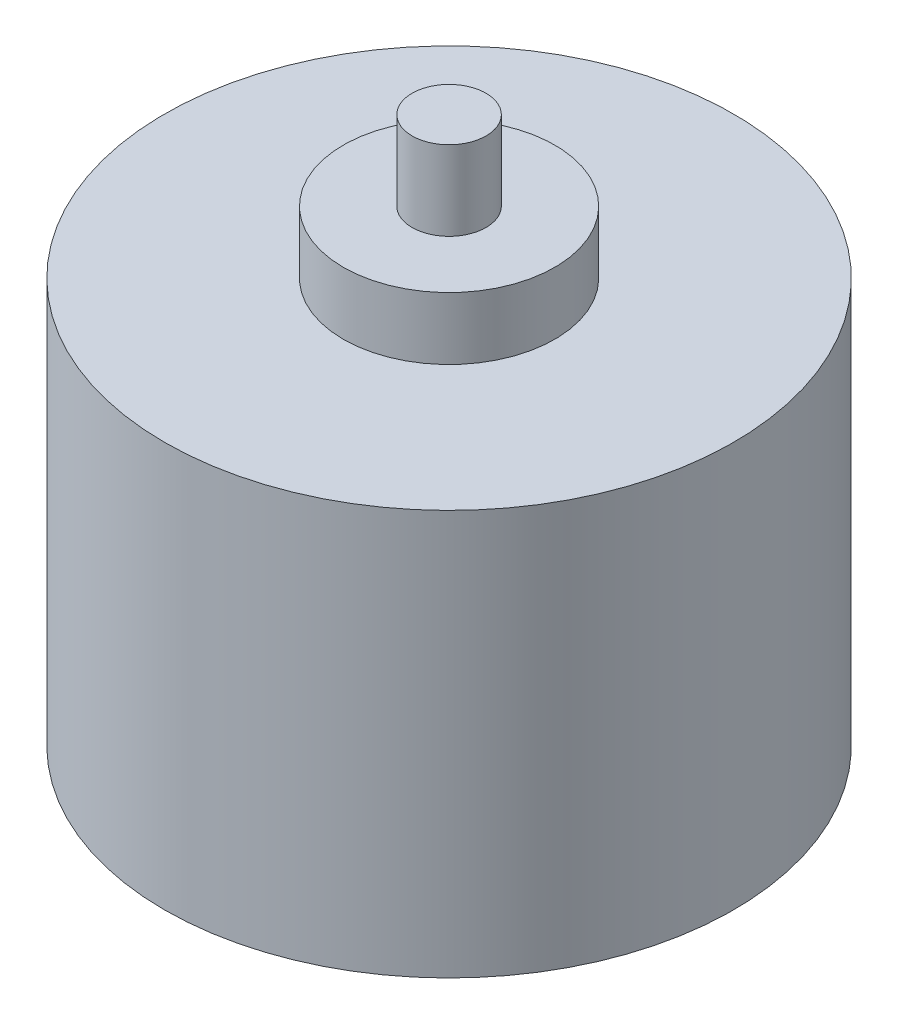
ISO-10303-21;
HEADER;
FILE_DESCRIPTION(('STEP AP214'),'2;1');
FILE_NAME('part.step','',(''),(''),'','','');
FILE_SCHEMA(('AUTOMOTIVE_DESIGN { 1 0 10303 214 1 1 1 1 }'));
ENDSEC;
DATA;
#1=APPLICATION_CONTEXT('core data for automotive mechanical design processes');
#2=APPLICATION_PROTOCOL_DEFINITION('international standard','automotive_design',2000,#1);
#3=PRODUCT_CONTEXT('',#1,'mechanical');
#4=PRODUCT('Part','Part','',(#3));
#5=PRODUCT_RELATED_PRODUCT_CATEGORY('part','',(#4));
#6=PRODUCT_DEFINITION_FORMATION('','',#4);
#7=PRODUCT_DEFINITION_CONTEXT('part definition',#1,'design');
#8=PRODUCT_DEFINITION('design','',#6,#7);
#9=PRODUCT_DEFINITION_SHAPE('','',#8);
#10=(LENGTH_UNIT() NAMED_UNIT(*) SI_UNIT(.MILLI.,.METRE.));
#11=(NAMED_UNIT(*) PLANE_ANGLE_UNIT() SI_UNIT($,.RADIAN.));
#12=(NAMED_UNIT(*) SI_UNIT($,.STERADIAN.) SOLID_ANGLE_UNIT());
#13=UNCERTAINTY_MEASURE_WITH_UNIT(LENGTH_MEASURE(1.E-05),#10,'distance_accuracy_value','');
#14=(GEOMETRIC_REPRESENTATION_CONTEXT(3) GLOBAL_UNCERTAINTY_ASSIGNED_CONTEXT((#13)) GLOBAL_UNIT_ASSIGNED_CONTEXT((#10,
#11,#12)) REPRESENTATION_CONTEXT('',''));
#15=CARTESIAN_POINT('',(0.,0.,0.));
#16=DIRECTION('',(0.,0.,1.));
#17=DIRECTION('',(1.,0.,0.));
#18=AXIS2_PLACEMENT_3D('',#15,#16,#17);
#19=CARTESIAN_POINT('',(0.,18.15,0.));
#20=DIRECTION('',(0.,1.,0.));
#21=DIRECTION('',(0.,0.,1.));
#22=AXIS2_PLACEMENT_3D('',#19,#20,#21);
#23=PLANE('',#22);
#24=CARTESIAN_POINT('',(0.,18.15,0.));
#25=DIRECTION('',(0.,1.,0.));
#26=DIRECTION('',(0.,0.,1.));
#27=AXIS2_PLACEMENT_3D('',#24,#25,#26);
#28=CIRCLE('',#27,12.75);
#29=CARTESIAN_POINT('',(0.,18.15,12.75));
#30=VERTEX_POINT('',#29);
#31=EDGE_CURVE('E35',#30,#30,#28,.T.);
#32=ORIENTED_EDGE('',*,*,#31,.T.);
#33=EDGE_LOOP('',(#32));
#34=FACE_BOUND('',#33,.T.);
#35=CARTESIAN_POINT('',(0.,18.15,0.));
#36=DIRECTION('',(0.,1.,0.));
#37=DIRECTION('',(0.,0.,1.));
#38=AXIS2_PLACEMENT_3D('',#35,#36,#37);
#39=CIRCLE('',#38,4.74345);
#40=CARTESIAN_POINT('',(0.,18.15,4.74345));
#41=VERTEX_POINT('',#40);
#42=EDGE_CURVE('E59',#41,#41,#39,.T.);
#43=ORIENTED_EDGE('',*,*,#42,.F.);
#44=EDGE_LOOP('',(#43));
#45=FACE_BOUND('',#44,.T.);
#46=ADVANCED_FACE('F27',(#34,#45),#23,.T.);
#47=CARTESIAN_POINT('',(0.,-1.016,0.));
#48=DIRECTION('',(0.,-1.,0.));
#49=DIRECTION('',(0.,0.,-1.));
#50=AXIS2_PLACEMENT_3D('',#47,#48,#49);
#51=PLANE('',#50);
#52=CARTESIAN_POINT('',(0.,-1.016,0.));
#53=DIRECTION('',(0.,-1.,0.));
#54=DIRECTION('',(0.,0.,-1.));
#55=AXIS2_PLACEMENT_3D('',#52,#53,#54);
#56=CIRCLE('',#55,4.74345);
#57=CARTESIAN_POINT('',(0.,-1.016,-4.74345));
#58=VERTEX_POINT('',#57);
#59=EDGE_CURVE('E47',#58,#58,#56,.T.);
#60=ORIENTED_EDGE('',*,*,#59,.T.);
#61=EDGE_LOOP('',(#60));
#62=FACE_BOUND('',#61,.T.);
#63=CARTESIAN_POINT('',(0.,-1.016,0.));
#64=DIRECTION('',(0.,-1.,0.));
#65=DIRECTION('',(0.,0.,-1.));
#66=AXIS2_PLACEMENT_3D('',#63,#64,#65);
#67=CIRCLE('',#66,1.65735);
#68=CARTESIAN_POINT('',(0.,-1.016,-1.65735));
#69=VERTEX_POINT('',#68);
#70=EDGE_CURVE('E53',#69,#69,#67,.T.);
#71=ORIENTED_EDGE('',*,*,#70,.F.);
#72=EDGE_LOOP('',(#71));
#73=FACE_BOUND('',#72,.T.);
#74=ADVANCED_FACE('F66',(#62,#73),#51,.T.);
#75=CARTESIAN_POINT('',(0.,0.,0.));
#76=DIRECTION('',(0.,1.,0.));
#77=DIRECTION('',(0.,0.,1.));
#78=AXIS2_PLACEMENT_3D('',#75,#76,#77);
#79=PLANE('',#78);
#80=CARTESIAN_POINT('',(0.,0.,0.));
#81=DIRECTION('',(0.,1.,0.));
#82=DIRECTION('',(0.,0.,1.));
#83=AXIS2_PLACEMENT_3D('',#80,#81,#82);
#84=CIRCLE('',#83,12.75);
#85=CARTESIAN_POINT('',(0.,0.,12.75));
#86=VERTEX_POINT('',#85);
#87=EDGE_CURVE('E39',#86,#86,#84,.T.);
#88=ORIENTED_EDGE('',*,*,#87,.F.);
#89=EDGE_LOOP('',(#88));
#90=FACE_BOUND('',#89,.T.);
#91=CARTESIAN_POINT('',(0.,0.,0.));
#92=DIRECTION('',(0.,1.,0.));
#93=DIRECTION('',(0.,0.,1.));
#94=AXIS2_PLACEMENT_3D('',#91,#92,#93);
#95=CIRCLE('',#94,4.74345);
#96=CARTESIAN_POINT('',(0.,0.,4.74345));
#97=VERTEX_POINT('',#96);
#98=EDGE_CURVE('E10',#97,#97,#95,.F.);
#99=ORIENTED_EDGE('',*,*,#98,.F.);
#100=EDGE_LOOP('',(#99));
#101=FACE_BOUND('',#100,.T.);
#102=ADVANCED_FACE('F73',(#90,#101),#79,.F.);
#103=CARTESIAN_POINT('',(0.,18.15,0.));
#104=DIRECTION('',(0.,-1.,0.));
#105=DIRECTION('',(0.,0.,-1.));
#106=AXIS2_PLACEMENT_3D('',#103,#104,#105);
#107=CYLINDRICAL_SURFACE('',#106,12.75);
#108=ORIENTED_EDGE('',*,*,#31,.F.);
#109=EDGE_LOOP('',(#108));
#110=FACE_BOUND('',#109,.T.);
#111=ORIENTED_EDGE('',*,*,#87,.T.);
#112=EDGE_LOOP('',(#111));
#113=FACE_BOUND('',#112,.T.);
#114=ADVANCED_FACE('F29',(#110,#113),#107,.T.);
#115=CARTESIAN_POINT('',(0.,-1.016,0.));
#116=DIRECTION('',(0.,1.,0.));
#117=DIRECTION('',(0.,0.,1.));
#118=AXIS2_PLACEMENT_3D('',#115,#116,#117);
#119=CYLINDRICAL_SURFACE('',#118,4.74345);
#120=ORIENTED_EDGE('',*,*,#59,.F.);
#121=EDGE_LOOP('',(#120));
#122=FACE_BOUND('',#121,.T.);
#123=ORIENTED_EDGE('',*,*,#98,.T.);
#124=EDGE_LOOP('',(#123));
#125=FACE_BOUND('',#124,.T.);
#126=ADVANCED_FACE('F88',(#122,#125),#119,.T.);
#127=CARTESIAN_POINT('',(0.,-7.366,0.));
#128=DIRECTION('',(0.,1.,0.));
#129=DIRECTION('',(0.,0.,1.));
#130=AXIS2_PLACEMENT_3D('',#127,#128,#129);
#131=CYLINDRICAL_SURFACE('',#130,1.65735);
#132=CARTESIAN_POINT('',(0.,-7.366,0.));
#133=DIRECTION('',(0.,-1.,0.));
#134=DIRECTION('',(0.,0.,-1.));
#135=AXIS2_PLACEMENT_3D('',#132,#133,#134);
#136=CIRCLE('',#135,1.65735);
#137=CARTESIAN_POINT('',(0.,-7.366,-1.65735));
#138=VERTEX_POINT('',#137);
#139=EDGE_CURVE('E50',#138,#138,#136,.T.);
#140=ORIENTED_EDGE('',*,*,#139,.F.);
#141=EDGE_LOOP('',(#140));
#142=FACE_BOUND('',#141,.T.);
#143=ORIENTED_EDGE('',*,*,#70,.T.);
#144=EDGE_LOOP('',(#143));
#145=FACE_BOUND('',#144,.T.);
#146=ADVANCED_FACE('F90',(#142,#145),#131,.T.);
#147=CARTESIAN_POINT('',(0.,-7.366,0.));
#148=DIRECTION('',(0.,-1.,0.));
#149=DIRECTION('',(0.,0.,-1.));
#150=AXIS2_PLACEMENT_3D('',#147,#148,#149);
#151=PLANE('',#150);
#152=ORIENTED_EDGE('',*,*,#139,.T.);
#153=EDGE_LOOP('',(#152));
#154=FACE_BOUND('',#153,.T.);
#155=ADVANCED_FACE('F95',(#154),#151,.T.);
#156=CARTESIAN_POINT('',(0.,20.944,0.));
#157=DIRECTION('',(0.,1.,0.));
#158=DIRECTION('',(0.,0.,1.));
#159=AXIS2_PLACEMENT_3D('',#156,#157,#158);
#160=PLANE('',#159);
#161=CARTESIAN_POINT('',(0.,20.944,0.));
#162=DIRECTION('',(0.,1.,0.));
#163=DIRECTION('',(0.,0.,1.));
#164=AXIS2_PLACEMENT_3D('',#161,#162,#163);
#165=CIRCLE('',#164,4.74345);
#166=CARTESIAN_POINT('',(0.,20.944,4.74345));
#167=VERTEX_POINT('',#166);
#168=EDGE_CURVE('E56',#167,#167,#165,.T.);
#169=ORIENTED_EDGE('',*,*,#168,.T.);
#170=EDGE_LOOP('',(#169));
#171=FACE_BOUND('',#170,.T.);
#172=CARTESIAN_POINT('',(0.,20.944,0.));
#173=DIRECTION('',(0.,1.,0.));
#174=DIRECTION('',(0.,0.,1.));
#175=AXIS2_PLACEMENT_3D('',#172,#173,#174);
#176=CIRCLE('',#175,1.65735);
#177=CARTESIAN_POINT('',(0.,20.944,1.65735));
#178=VERTEX_POINT('',#177);
#179=EDGE_CURVE('E31',#178,#178,#176,.T.);
#180=ORIENTED_EDGE('',*,*,#179,.F.);
#181=EDGE_LOOP('',(#180));
#182=FACE_BOUND('',#181,.T.);
#183=ADVANCED_FACE('F98',(#171,#182),#160,.T.);
#184=CARTESIAN_POINT('',(0.,20.944,0.));
#185=DIRECTION('',(0.,-1.,0.));
#186=DIRECTION('',(0.,0.,-1.));
#187=AXIS2_PLACEMENT_3D('',#184,#185,#186);
#188=CYLINDRICAL_SURFACE('',#187,4.74345);
#189=ORIENTED_EDGE('',*,*,#168,.F.);
#190=EDGE_LOOP('',(#189));
#191=FACE_BOUND('',#190,.T.);
#192=ORIENTED_EDGE('',*,*,#42,.T.);
#193=EDGE_LOOP('',(#192));
#194=FACE_BOUND('',#193,.T.);
#195=ADVANCED_FACE('F63',(#191,#194),#188,.T.);
#196=CARTESIAN_POINT('',(0.,24.5,0.));
#197=DIRECTION('',(0.,1.,0.));
#198=DIRECTION('',(0.,0.,1.));
#199=AXIS2_PLACEMENT_3D('',#196,#197,#198);
#200=PLANE('',#199);
#201=CARTESIAN_POINT('',(0.,24.5,0.));
#202=DIRECTION('',(0.,1.,0.));
#203=DIRECTION('',(0.,0.,1.));
#204=AXIS2_PLACEMENT_3D('',#201,#202,#203);
#205=CIRCLE('',#204,1.65735);
#206=CARTESIAN_POINT('',(0.,24.5,1.65735));
#207=VERTEX_POINT('',#206);
#208=EDGE_CURVE('E44',#207,#207,#205,.T.);
#209=ORIENTED_EDGE('',*,*,#208,.T.);
#210=EDGE_LOOP('',(#209));
#211=FACE_BOUND('',#210,.T.);
#212=ADVANCED_FACE('F83',(#211),#200,.T.);
#213=CARTESIAN_POINT('',(0.,24.5,0.));
#214=DIRECTION('',(0.,-1.,0.));
#215=DIRECTION('',(0.,0.,-1.));
#216=AXIS2_PLACEMENT_3D('',#213,#214,#215);
#217=CYLINDRICAL_SURFACE('',#216,1.65735);
#218=ORIENTED_EDGE('',*,*,#179,.T.);
#219=EDGE_LOOP('',(#218));
#220=FACE_BOUND('',#219,.T.);
#221=ORIENTED_EDGE('',*,*,#208,.F.);
#222=EDGE_LOOP('',(#221));
#223=FACE_BOUND('',#222,.T.);
#224=ADVANCED_FACE('F80',(#220,#223),#217,.T.);
#225=CLOSED_SHELL('',(#46,#74,#102,#114,#126,#146,#155,#183,#195,#212,#224));
#226=MANIFOLD_SOLID_BREP('B2',#225);
#227=ADVANCED_BREP_SHAPE_REPRESENTATION('',(#18,#226),#14);
#228=SHAPE_DEFINITION_REPRESENTATION(#9,#227);
ENDSEC;
END-ISO-10303-21;
